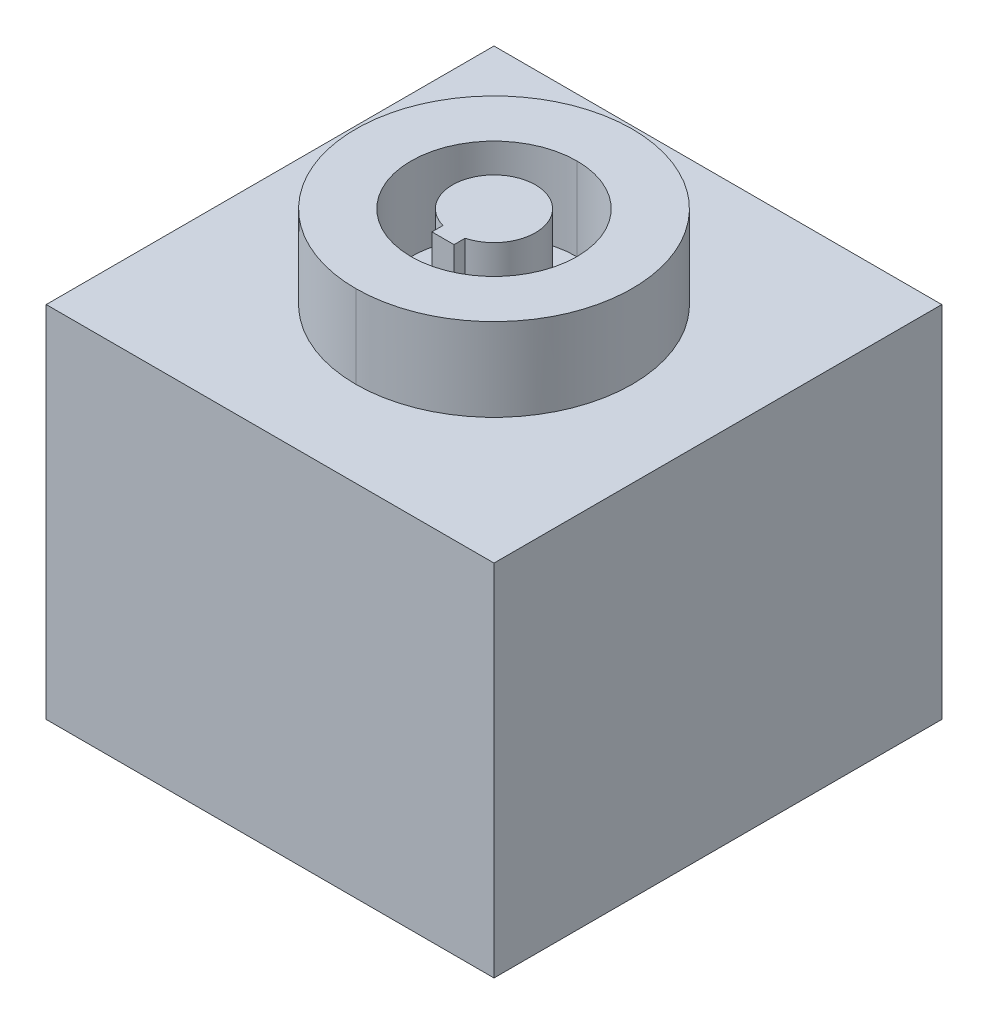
ISO-10303-21;
HEADER;
FILE_DESCRIPTION(('STEP AP214'),'2;1');
FILE_NAME('part.step','',(''),(''),'','','');
FILE_SCHEMA(('AUTOMOTIVE_DESIGN { 1 0 10303 214 1 1 1 1 }'));
ENDSEC;
DATA;
#1=APPLICATION_CONTEXT('core data for automotive mechanical design processes');
#2=APPLICATION_PROTOCOL_DEFINITION('international standard','automotive_design',2000,#1);
#3=PRODUCT_CONTEXT('',#1,'mechanical');
#4=PRODUCT('Part','Part','',(#3));
#5=PRODUCT_RELATED_PRODUCT_CATEGORY('part','',(#4));
#6=PRODUCT_DEFINITION_FORMATION('','',#4);
#7=PRODUCT_DEFINITION_CONTEXT('part definition',#1,'design');
#8=PRODUCT_DEFINITION('design','',#6,#7);
#9=PRODUCT_DEFINITION_SHAPE('','',#8);
#10=(LENGTH_UNIT() NAMED_UNIT(*) SI_UNIT(.MILLI.,.METRE.));
#11=(NAMED_UNIT(*) PLANE_ANGLE_UNIT() SI_UNIT($,.RADIAN.));
#12=(NAMED_UNIT(*) SI_UNIT($,.STERADIAN.) SOLID_ANGLE_UNIT());
#13=UNCERTAINTY_MEASURE_WITH_UNIT(LENGTH_MEASURE(1.E-05),#10,'distance_accuracy_value','');
#14=(GEOMETRIC_REPRESENTATION_CONTEXT(3) GLOBAL_UNCERTAINTY_ASSIGNED_CONTEXT((#13)) GLOBAL_UNIT_ASSIGNED_CONTEXT((#10,
#11,#12)) REPRESENTATION_CONTEXT('',''));
#15=CARTESIAN_POINT('',(0.,0.,0.));
#16=DIRECTION('',(0.,0.,1.));
#17=DIRECTION('',(1.,0.,0.));
#18=AXIS2_PLACEMENT_3D('',#15,#16,#17);
#19=CARTESIAN_POINT('',(-40.5,0.,-40.5));
#20=DIRECTION('',(0.,-1.,0.));
#21=DIRECTION('',(1.,0.,0.));
#22=AXIS2_PLACEMENT_3D('',#19,#20,#21);
#23=PLANE('',#22);
#24=CARTESIAN_POINT('',(-40.5,0.,40.5));
#25=DIRECTION('',(1.,0.,0.));
#26=VECTOR('',#25,1.);
#27=LINE('',#24,#26);
#28=CARTESIAN_POINT('',(-40.5,0.,40.5));
#29=VERTEX_POINT('',#28);
#30=CARTESIAN_POINT('',(40.5,0.,40.5));
#31=VERTEX_POINT('',#30);
#32=EDGE_CURVE('E11',#29,#31,#27,.T.);
#33=ORIENTED_EDGE('',*,*,#32,.F.);
#34=CARTESIAN_POINT('',(-40.5,0.,-40.5));
#35=DIRECTION('',(0.,0.,1.));
#36=VECTOR('',#35,1.);
#37=LINE('',#34,#36);
#38=CARTESIAN_POINT('',(-40.5,0.,-40.5));
#39=VERTEX_POINT('',#38);
#40=EDGE_CURVE('E25',#39,#29,#37,.T.);
#41=ORIENTED_EDGE('',*,*,#40,.F.);
#42=CARTESIAN_POINT('',(40.5,0.,-40.5));
#43=DIRECTION('',(-1.,0.,0.));
#44=VECTOR('',#43,1.);
#45=LINE('',#42,#44);
#46=CARTESIAN_POINT('',(40.5,0.,-40.5));
#47=VERTEX_POINT('',#46);
#48=EDGE_CURVE('E491',#47,#39,#45,.T.);
#49=ORIENTED_EDGE('',*,*,#48,.F.);
#50=CARTESIAN_POINT('',(40.5,0.,40.5));
#51=DIRECTION('',(0.,0.,-1.));
#52=VECTOR('',#51,1.);
#53=LINE('',#50,#52);
#54=EDGE_CURVE('E489',#31,#47,#53,.T.);
#55=ORIENTED_EDGE('',*,*,#54,.F.);
#56=EDGE_LOOP('',(#33,#41,#49,#55));
#57=FACE_BOUND('',#56,.T.);
#58=CARTESIAN_POINT('',(25.5,0.,25.5));
#59=DIRECTION('',(0.,0.,-1.));
#60=VECTOR('',#59,1.);
#61=LINE('',#58,#60);
#62=CARTESIAN_POINT('',(25.5,0.,25.5));
#63=VERTEX_POINT('',#62);
#64=CARTESIAN_POINT('',(25.5,0.,-25.5));
#65=VERTEX_POINT('',#64);
#66=EDGE_CURVE('E487',#63,#65,#61,.T.);
#67=ORIENTED_EDGE('',*,*,#66,.T.);
#68=CARTESIAN_POINT('',(25.5,0.,-25.5));
#69=DIRECTION('',(-1.,0.,0.));
#70=VECTOR('',#69,1.);
#71=LINE('',#68,#70);
#72=CARTESIAN_POINT('',(-25.5,0.,-25.5));
#73=VERTEX_POINT('',#72);
#74=EDGE_CURVE('E485',#65,#73,#71,.T.);
#75=ORIENTED_EDGE('',*,*,#74,.T.);
#76=CARTESIAN_POINT('',(-25.5,0.,-25.5));
#77=DIRECTION('',(0.,0.,1.));
#78=VECTOR('',#77,1.);
#79=LINE('',#76,#78);
#80=CARTESIAN_POINT('',(-25.5,0.,25.5));
#81=VERTEX_POINT('',#80);
#82=EDGE_CURVE('E482',#73,#81,#79,.T.);
#83=ORIENTED_EDGE('',*,*,#82,.T.);
#84=CARTESIAN_POINT('',(-25.5,0.,25.5));
#85=DIRECTION('',(1.,0.,0.));
#86=VECTOR('',#85,1.);
#87=LINE('',#84,#86);
#88=EDGE_CURVE('E480',#81,#63,#87,.T.);
#89=ORIENTED_EDGE('',*,*,#88,.T.);
#90=EDGE_LOOP('',(#67,#75,#83,#89));
#91=FACE_BOUND('',#90,.T.);
#92=ADVANCED_FACE('F16',(#57,#91),#23,.T.);
#93=CARTESIAN_POINT('',(25.5,0.,25.5));
#94=DIRECTION('',(0.,0.,-1.));
#95=DIRECTION('',(-1.,0.,0.));
#96=AXIS2_PLACEMENT_3D('',#93,#94,#95);
#97=PLANE('',#96);
#98=ORIENTED_EDGE('',*,*,#88,.F.);
#99=CARTESIAN_POINT('',(-25.5,50.,25.5));
#100=DIRECTION('',(0.,-1.,0.));
#101=VECTOR('',#100,1.);
#102=LINE('',#99,#101);
#103=CARTESIAN_POINT('',(-25.5,50.,25.5));
#104=VERTEX_POINT('',#103);
#105=EDGE_CURVE('E478',#104,#81,#102,.T.);
#106=ORIENTED_EDGE('',*,*,#105,.F.);
#107=CARTESIAN_POINT('',(-25.5,50.,25.5));
#108=DIRECTION('',(1.,0.,0.));
#109=VECTOR('',#108,1.);
#110=LINE('',#107,#109);
#111=CARTESIAN_POINT('',(25.5,50.,25.5));
#112=VERTEX_POINT('',#111);
#113=EDGE_CURVE('E474',#104,#112,#110,.T.);
#114=ORIENTED_EDGE('',*,*,#113,.T.);
#115=CARTESIAN_POINT('',(25.5,50.,25.5));
#116=DIRECTION('',(0.,-1.,0.));
#117=VECTOR('',#116,1.);
#118=LINE('',#115,#117);
#119=EDGE_CURVE('E469',#112,#63,#118,.T.);
#120=ORIENTED_EDGE('',*,*,#119,.T.);
#121=EDGE_LOOP('',(#98,#106,#114,#120));
#122=FACE_BOUND('',#121,.T.);
#123=ADVANCED_FACE('F730',(#122),#97,.T.);
#124=CARTESIAN_POINT('',(25.5,0.,-25.5));
#125=DIRECTION('',(-1.,0.,0.));
#126=DIRECTION('',(0.,0.,1.));
#127=AXIS2_PLACEMENT_3D('',#124,#125,#126);
#128=PLANE('',#127);
#129=ORIENTED_EDGE('',*,*,#66,.F.);
#130=ORIENTED_EDGE('',*,*,#119,.F.);
#131=CARTESIAN_POINT('',(25.5,50.,25.5));
#132=DIRECTION('',(0.,0.,-1.));
#133=VECTOR('',#132,1.);
#134=LINE('',#131,#133);
#135=CARTESIAN_POINT('',(25.5,50.,-25.5));
#136=VERTEX_POINT('',#135);
#137=EDGE_CURVE('E465',#112,#136,#134,.T.);
#138=ORIENTED_EDGE('',*,*,#137,.T.);
#139=CARTESIAN_POINT('',(25.5,50.,-25.5));
#140=DIRECTION('',(0.,-1.,0.));
#141=VECTOR('',#140,1.);
#142=LINE('',#139,#141);
#143=EDGE_CURVE('E460',#136,#65,#142,.T.);
#144=ORIENTED_EDGE('',*,*,#143,.T.);
#145=EDGE_LOOP('',(#129,#130,#138,#144));
#146=FACE_BOUND('',#145,.T.);
#147=ADVANCED_FACE('F667',(#146),#128,.T.);
#148=CARTESIAN_POINT('',(-25.5,0.,-25.5));
#149=DIRECTION('',(0.,0.,1.));
#150=DIRECTION('',(1.,0.,0.));
#151=AXIS2_PLACEMENT_3D('',#148,#149,#150);
#152=PLANE('',#151);
#153=ORIENTED_EDGE('',*,*,#74,.F.);
#154=ORIENTED_EDGE('',*,*,#143,.F.);
#155=CARTESIAN_POINT('',(25.5,50.,-25.5));
#156=DIRECTION('',(-1.,0.,0.));
#157=VECTOR('',#156,1.);
#158=LINE('',#155,#157);
#159=CARTESIAN_POINT('',(-25.5,50.,-25.5));
#160=VERTEX_POINT('',#159);
#161=EDGE_CURVE('E455',#136,#160,#158,.T.);
#162=ORIENTED_EDGE('',*,*,#161,.T.);
#163=CARTESIAN_POINT('',(-25.5,50.,-25.5));
#164=DIRECTION('',(0.,-1.,0.));
#165=VECTOR('',#164,1.);
#166=LINE('',#163,#165);
#167=EDGE_CURVE('E447',#160,#73,#166,.T.);
#168=ORIENTED_EDGE('',*,*,#167,.T.);
#169=EDGE_LOOP('',(#153,#154,#162,#168));
#170=FACE_BOUND('',#169,.T.);
#171=ADVANCED_FACE('F658',(#170),#152,.T.);
#172=CARTESIAN_POINT('',(-25.5,0.,25.5));
#173=DIRECTION('',(1.,0.,0.));
#174=DIRECTION('',(0.,0.,-1.));
#175=AXIS2_PLACEMENT_3D('',#172,#173,#174);
#176=PLANE('',#175);
#177=ORIENTED_EDGE('',*,*,#82,.F.);
#178=ORIENTED_EDGE('',*,*,#167,.F.);
#179=CARTESIAN_POINT('',(-25.5,50.,-25.5));
#180=DIRECTION('',(0.,0.,1.));
#181=VECTOR('',#180,1.);
#182=LINE('',#179,#181);
#183=EDGE_CURVE('E443',#160,#104,#182,.T.);
#184=ORIENTED_EDGE('',*,*,#183,.T.);
#185=ORIENTED_EDGE('',*,*,#105,.T.);
#186=EDGE_LOOP('',(#177,#178,#184,#185));
#187=FACE_BOUND('',#186,.T.);
#188=ADVANCED_FACE('F592',(#187),#176,.T.);
#189=CARTESIAN_POINT('',(-25.5,50.,25.5));
#190=DIRECTION('',(0.,-1.,0.));
#191=DIRECTION('',(0.,0.,-1.));
#192=AXIS2_PLACEMENT_3D('',#189,#190,#191);
#193=PLANE('',#192);
#194=ORIENTED_EDGE('',*,*,#161,.F.);
#195=ORIENTED_EDGE('',*,*,#137,.F.);
#196=ORIENTED_EDGE('',*,*,#113,.F.);
#197=ORIENTED_EDGE('',*,*,#183,.F.);
#198=EDGE_LOOP('',(#194,#195,#196,#197));
#199=FACE_BOUND('',#198,.T.);
#200=ADVANCED_FACE('F583',(#199),#193,.T.);
#201=CARTESIAN_POINT('',(40.5,0.,-40.5));
#202=DIRECTION('',(1.,0.,0.));
#203=DIRECTION('',(0.,1.,0.));
#204=AXIS2_PLACEMENT_3D('',#201,#202,#203);
#205=PLANE('',#204);
#206=ORIENTED_EDGE('',*,*,#54,.T.);
#207=CARTESIAN_POINT('',(40.5,65.,-40.5));
#208=DIRECTION('',(0.,-1.,0.));
#209=VECTOR('',#208,1.);
#210=LINE('',#207,#209);
#211=CARTESIAN_POINT('',(40.5,65.,-40.5));
#212=VERTEX_POINT('',#211);
#213=EDGE_CURVE('E440',#212,#47,#210,.T.);
#214=ORIENTED_EDGE('',*,*,#213,.F.);
#215=CARTESIAN_POINT('',(40.5,65.,40.5));
#216=DIRECTION('',(0.,0.,-1.));
#217=VECTOR('',#216,1.);
#218=LINE('',#215,#217);
#219=CARTESIAN_POINT('',(40.5,65.,40.5));
#220=VERTEX_POINT('',#219);
#221=EDGE_CURVE('E435',#220,#212,#218,.T.);
#222=ORIENTED_EDGE('',*,*,#221,.F.);
#223=CARTESIAN_POINT('',(40.5,65.,40.5));
#224=DIRECTION('',(0.,-1.,0.));
#225=VECTOR('',#224,1.);
#226=LINE('',#223,#225);
#227=EDGE_CURVE('E432',#220,#31,#226,.T.);
#228=ORIENTED_EDGE('',*,*,#227,.T.);
#229=EDGE_LOOP('',(#206,#214,#222,#228));
#230=FACE_BOUND('',#229,.T.);
#231=ADVANCED_FACE('F515',(#230),#205,.T.);
#232=CARTESIAN_POINT('',(40.5,0.,40.5));
#233=DIRECTION('',(0.,0.,1.));
#234=DIRECTION('',(0.,1.,0.));
#235=AXIS2_PLACEMENT_3D('',#232,#233,#234);
#236=PLANE('',#235);
#237=ORIENTED_EDGE('',*,*,#32,.T.);
#238=ORIENTED_EDGE('',*,*,#227,.F.);
#239=CARTESIAN_POINT('',(-40.5,65.,40.5));
#240=DIRECTION('',(1.,0.,0.));
#241=VECTOR('',#240,1.);
#242=LINE('',#239,#241);
#243=CARTESIAN_POINT('',(-40.5,65.,40.5));
#244=VERTEX_POINT('',#243);
#245=EDGE_CURVE('E428',#244,#220,#242,.T.);
#246=ORIENTED_EDGE('',*,*,#245,.F.);
#247=CARTESIAN_POINT('',(-40.5,65.,40.5));
#248=DIRECTION('',(0.,-1.,0.));
#249=VECTOR('',#248,1.);
#250=LINE('',#247,#249);
#251=EDGE_CURVE('E425',#244,#29,#250,.T.);
#252=ORIENTED_EDGE('',*,*,#251,.T.);
#253=EDGE_LOOP('',(#237,#238,#246,#252));
#254=FACE_BOUND('',#253,.T.);
#255=ADVANCED_FACE('F506',(#254),#236,.T.);
#256=CARTESIAN_POINT('',(-40.5,0.,40.5));
#257=DIRECTION('',(-1.,0.,0.));
#258=DIRECTION('',(0.,1.,0.));
#259=AXIS2_PLACEMENT_3D('',#256,#257,#258);
#260=PLANE('',#259);
#261=ORIENTED_EDGE('',*,*,#40,.T.);
#262=ORIENTED_EDGE('',*,*,#251,.F.);
#263=CARTESIAN_POINT('',(-40.5,65.,-40.5));
#264=DIRECTION('',(0.,0.,1.));
#265=VECTOR('',#264,1.);
#266=LINE('',#263,#265);
#267=CARTESIAN_POINT('',(-40.5,65.,-40.5));
#268=VERTEX_POINT('',#267);
#269=EDGE_CURVE('E420',#268,#244,#266,.T.);
#270=ORIENTED_EDGE('',*,*,#269,.F.);
#271=CARTESIAN_POINT('',(-40.5,65.,-40.5));
#272=DIRECTION('',(0.,-1.,0.));
#273=VECTOR('',#272,1.);
#274=LINE('',#271,#273);
#275=EDGE_CURVE('E414',#268,#39,#274,.T.);
#276=ORIENTED_EDGE('',*,*,#275,.T.);
#277=EDGE_LOOP('',(#261,#262,#270,#276));
#278=FACE_BOUND('',#277,.T.);
#279=ADVANCED_FACE('F495',(#278),#260,.T.);
#280=CARTESIAN_POINT('',(-40.5,0.,-40.5));
#281=DIRECTION('',(0.,0.,-1.));
#282=DIRECTION('',(0.,1.,0.));
#283=AXIS2_PLACEMENT_3D('',#280,#281,#282);
#284=PLANE('',#283);
#285=ORIENTED_EDGE('',*,*,#48,.T.);
#286=ORIENTED_EDGE('',*,*,#275,.F.);
#287=CARTESIAN_POINT('',(40.5,65.,-40.5));
#288=DIRECTION('',(-1.,0.,0.));
#289=VECTOR('',#288,1.);
#290=LINE('',#287,#289);
#291=EDGE_CURVE('E411',#212,#268,#290,.T.);
#292=ORIENTED_EDGE('',*,*,#291,.F.);
#293=ORIENTED_EDGE('',*,*,#213,.T.);
#294=EDGE_LOOP('',(#285,#286,#292,#293));
#295=FACE_BOUND('',#294,.T.);
#296=ADVANCED_FACE('F869',(#295),#284,.T.);
#297=CARTESIAN_POINT('',(-40.5,65.,40.5));
#298=DIRECTION('',(0.,1.,0.));
#299=DIRECTION('',(1.,0.,0.));
#300=AXIS2_PLACEMENT_3D('',#297,#298,#299);
#301=PLANE('',#300);
#302=ORIENTED_EDGE('',*,*,#221,.T.);
#303=ORIENTED_EDGE('',*,*,#291,.T.);
#304=ORIENTED_EDGE('',*,*,#269,.T.);
#305=ORIENTED_EDGE('',*,*,#245,.T.);
#306=EDGE_LOOP('',(#302,#303,#304,#305));
#307=FACE_BOUND('',#306,.T.);
#308=CARTESIAN_POINT('',(0.,65.,0.));
#309=DIRECTION('',(0.,1.,0.));
#310=DIRECTION('',(0.,0.,-1.));
#311=AXIS2_PLACEMENT_3D('',#308,#309,#310);
#312=CIRCLE('',#311,25.);
#313=CARTESIAN_POINT('',(0.,65.,-25.));
#314=VERTEX_POINT('',#313);
#315=CARTESIAN_POINT('',(-9.12550270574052E-11,65.,25.0000241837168));
#316=VERTEX_POINT('',#315);
#317=EDGE_CURVE('E408',#314,#316,#312,.T.);
#318=ORIENTED_EDGE('',*,*,#317,.F.);
#319=CARTESIAN_POINT('',(0.,65.,0.));
#320=DIRECTION('',(0.,1.,0.));
#321=DIRECTION('',(-3.6556199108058E-12,0.,1.));
#322=AXIS2_PLACEMENT_3D('',#319,#320,#321);
#323=CIRCLE('',#322,25.);
#324=EDGE_CURVE('E405',#316,#314,#323,.T.);
#325=ORIENTED_EDGE('',*,*,#324,.F.);
#326=EDGE_LOOP('',(#318,#325));
#327=FACE_BOUND('',#326,.T.);
#328=ADVANCED_FACE('F875',(#307,#327),#301,.T.);
#329=CARTESIAN_POINT('',(0.,80.,0.));
#330=DIRECTION('',(0.,-1.,0.));
#331=DIRECTION('',(-1.,0.,-1.82526788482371E-12));
#332=AXIS2_PLACEMENT_3D('',#329,#330,#331);
#333=CYLINDRICAL_SURFACE('',#332,25.);
#334=ORIENTED_EDGE('',*,*,#324,.T.);
#335=CARTESIAN_POINT('',(0.,80.,-25.));
#336=DIRECTION('',(0.,-1.,0.));
#337=VECTOR('',#336,1.);
#338=LINE('',#335,#337);
#339=CARTESIAN_POINT('',(0.,80.,-25.));
#340=VERTEX_POINT('',#339);
#341=EDGE_CURVE('E402',#340,#314,#338,.T.);
#342=ORIENTED_EDGE('',*,*,#341,.F.);
#343=CARTESIAN_POINT('',(0.,80.,25.));
#344=CARTESIAN_POINT('',(6.6304899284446,80.,24.9999026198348));
#345=CARTESIAN_POINT('',(12.9891747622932,80.,22.3661522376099));
#346=CARTESIAN_POINT('',(20.795524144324,80.,14.559822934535));
#347=CARTESIAN_POINT('',(23.0332057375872,80.,10.6729440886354));
#348=CARTESIAN_POINT('',(25.8643739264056,80.,0.0023601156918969));
#349=CARTESIAN_POINT('',(24.9491235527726,80.,-6.8191926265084));
#350=CARTESIAN_POINT('',(19.0705976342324,80.,-16.9437262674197));
#351=CARTESIAN_POINT('',(15.2448310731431,80.,-20.4541113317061));
#352=CARTESIAN_POINT('',(7.3198449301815,80.,-24.1864229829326));
#353=CARTESIAN_POINT('',(3.6829281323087,80.,-24.9999459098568));
#354=CARTESIAN_POINT('',(0.,80.,-25.));
#355=B_SPLINE_CURVE_WITH_KNOTS('',3,(#343,#344,#345,#346,#347,#348,#349,#350,#351,#352,#353,
#354),.UNSPECIFIED.,.F.,.F.,(4,2,2,2,2,4),(0.,0.250867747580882,0.417695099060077,
0.668562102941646,0.860652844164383,1.),.UNSPECIFIED.);
#356=CARTESIAN_POINT('',(0.,80.,25.));
#357=VERTEX_POINT('',#356);
#358=EDGE_CURVE('E397',#357,#340,#355,.T.);
#359=ORIENTED_EDGE('',*,*,#358,.F.);
#360=CARTESIAN_POINT('',(-9.13238843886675E-11,65.,25.));
#361=CARTESIAN_POINT('',(-8.75171969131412E-11,65.625,25.));
#362=CARTESIAN_POINT('',(-8.37163072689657E-11,66.25,25.));
#363=CARTESIAN_POINT('',(-7.61163783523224E-11,67.5,25.));
#364=CARTESIAN_POINT('',(-7.23173390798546E-11,68.125,25.));
#365=CARTESIAN_POINT('',(-6.47113656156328E-11,69.375,25.));
#366=CARTESIAN_POINT('',(-6.09044314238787E-11,70.,25.));
#367=CARTESIAN_POINT('',(-5.32980878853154E-11,71.25,25.));
#368=CARTESIAN_POINT('',(-4.9498678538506E-11,71.875,25.));
#369=CARTESIAN_POINT('',(-4.18998598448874E-11,73.125,25.));
#370=CARTESIAN_POINT('',(-3.8100450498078E-11,73.75,25.));
#371=CARTESIAN_POINT('',(-3.04941069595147E-11,75.,25.));
#372=CARTESIAN_POINT('',(-2.66871727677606E-11,75.625,25.));
#373=CARTESIAN_POINT('',(-1.90811993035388E-11,76.875,25.));
#374=CARTESIAN_POINT('',(-1.5282160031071E-11,77.5,25.));
#375=CARTESIAN_POINT('',(-7.68223111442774E-12,78.75,25.));
#376=CARTESIAN_POINT('',(-3.88134147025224E-12,79.375,25.));
#377=CARTESIAN_POINT('',(0.,80.,25.));
#378=B_SPLINE_CURVE_WITH_KNOTS('',3,(#360,#361,#362,#363,#364,#365,#366,#367,#368,#369,#370,
#371,#372,#373,#374,#375,#376,#377),.UNSPECIFIED.,.F.,.F.,(4,2,2,2,2,2,2,2,4),(0.,1.875,3.75,
5.62499999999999,7.49999999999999,9.37499999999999,11.25,13.125,15.),.UNSPECIFIED.);
#379=EDGE_CURVE('E391',#316,#357,#378,.T.);
#380=ORIENTED_EDGE('',*,*,#379,.F.);
#381=EDGE_LOOP('',(#334,#342,#359,#380));
#382=FACE_BOUND('',#381,.T.);
#383=ADVANCED_FACE('F881',(#382),#333,.T.);
#384=CARTESIAN_POINT('',(0.,80.,0.));
#385=DIRECTION('',(0.,-1.,0.));
#386=DIRECTION('',(1.,0.,0.));
#387=AXIS2_PLACEMENT_3D('',#384,#385,#386);
#388=CYLINDRICAL_SURFACE('',#387,25.);
#389=CARTESIAN_POINT('',(0.,80.,-25.));
#390=CARTESIAN_POINT('',(-6.6304899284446,80.,-24.9999026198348));
#391=CARTESIAN_POINT('',(-12.9891747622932,80.,-22.3661522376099));
#392=CARTESIAN_POINT('',(-20.7955241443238,80.,-14.559822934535));
#393=CARTESIAN_POINT('',(-23.0332057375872,80.,-10.6729440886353));
#394=CARTESIAN_POINT('',(-25.8643739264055,80.,-0.00236011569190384));
#395=CARTESIAN_POINT('',(-24.9491235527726,80.,6.8191926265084));
#396=CARTESIAN_POINT('',(-19.0705976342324,80.,16.9437262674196));
#397=CARTESIAN_POINT('',(-15.2448310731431,80.,20.4541113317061));
#398=CARTESIAN_POINT('',(-7.3198449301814,80.,24.1864229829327));
#399=CARTESIAN_POINT('',(-3.6829281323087,80.,24.9999459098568));
#400=CARTESIAN_POINT('',(0.,80.,25.));
#401=B_SPLINE_CURVE_WITH_KNOTS('',3,(#389,#390,#391,#392,#393,#394,#395,#396,#397,#398,#399,
#400),.UNSPECIFIED.,.F.,.F.,(4,2,2,2,2,4),(0.,0.250867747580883,0.417695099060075,
0.668562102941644,0.86065284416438,1.),.UNSPECIFIED.);
#402=EDGE_CURVE('E388',#340,#357,#401,.T.);
#403=ORIENTED_EDGE('',*,*,#402,.F.);
#404=ORIENTED_EDGE('',*,*,#341,.T.);
#405=ORIENTED_EDGE('',*,*,#317,.T.);
#406=ORIENTED_EDGE('',*,*,#379,.T.);
#407=EDGE_LOOP('',(#403,#404,#405,#406));
#408=FACE_BOUND('',#407,.T.);
#409=ADVANCED_FACE('F888',(#408),#388,.T.);
#410=CARTESIAN_POINT('',(-25.8643739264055,80.,-25.));
#411=DIRECTION('',(0.,1.,0.));
#412=DIRECTION('',(0.,0.,1.));
#413=AXIS2_PLACEMENT_3D('',#410,#411,#412);
#414=PLANE('',#413);
#415=ORIENTED_EDGE('',*,*,#358,.T.);
#416=ORIENTED_EDGE('',*,*,#402,.T.);
#417=EDGE_LOOP('',(#415,#416));
#418=FACE_BOUND('',#417,.T.);
#419=CARTESIAN_POINT('',(0.,80.,0.));
#420=DIRECTION('',(0.,1.,0.));
#421=DIRECTION('',(0.,0.,-1.));
#422=AXIS2_PLACEMENT_3D('',#419,#420,#421);
#423=CIRCLE('',#422,15.);
#424=CARTESIAN_POINT('',(0.,80.,-15.));
#425=VERTEX_POINT('',#424);
#426=CARTESIAN_POINT('',(0.,80.,15.));
#427=VERTEX_POINT('',#426);
#428=EDGE_CURVE('E386',#425,#427,#423,.T.);
#429=ORIENTED_EDGE('',*,*,#428,.F.);
#430=CARTESIAN_POINT('',(0.,80.,0.));
#431=DIRECTION('',(0.,1.,0.));
#432=DIRECTION('',(0.,0.,1.));
#433=AXIS2_PLACEMENT_3D('',#430,#431,#432);
#434=CIRCLE('',#433,15.);
#435=EDGE_CURVE('E384',#427,#425,#434,.T.);
#436=ORIENTED_EDGE('',*,*,#435,.F.);
#437=EDGE_LOOP('',(#429,#436));
#438=FACE_BOUND('',#437,.T.);
#439=ADVANCED_FACE('F895',(#418,#438),#414,.T.);
#440=CARTESIAN_POINT('',(0.,80.,0.));
#441=DIRECTION('',(0.,-1.,0.));
#442=DIRECTION('',(-1.,0.,0.));
#443=AXIS2_PLACEMENT_3D('',#440,#441,#442);
#444=CYLINDRICAL_SURFACE('',#443,15.);
#445=ORIENTED_EDGE('',*,*,#435,.T.);
#446=CARTESIAN_POINT('',(0.,80.,-15.));
#447=DIRECTION('',(0.,-1.,0.));
#448=VECTOR('',#447,1.);
#449=LINE('',#446,#448);
#450=CARTESIAN_POINT('',(0.,65.,-15.));
#451=VERTEX_POINT('',#450);
#452=EDGE_CURVE('E383',#425,#451,#449,.T.);
#453=ORIENTED_EDGE('',*,*,#452,.T.);
#454=CARTESIAN_POINT('',(0.,65.,15.));
#455=CARTESIAN_POINT('',(3.9782939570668,65.,14.9999415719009));
#456=CARTESIAN_POINT('',(7.793504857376,65.,13.4196913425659));
#457=CARTESIAN_POINT('',(12.4773144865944,65.,8.73589376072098));
#458=CARTESIAN_POINT('',(13.8199234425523,65.,6.40376645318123));
#459=CARTESIAN_POINT('',(15.5186243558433,65.,0.00141606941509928));
#460=CARTESIAN_POINT('',(14.9694741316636,65.,-4.091515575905));
#461=CARTESIAN_POINT('',(11.4423585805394,65.,-10.1662357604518));
#462=CARTESIAN_POINT('',(9.1468986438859,65.,-12.2724667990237));
#463=CARTESIAN_POINT('',(4.3919069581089,65.,-14.5118537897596));
#464=CARTESIAN_POINT('',(2.2097568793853,65.,-14.9999675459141));
#465=CARTESIAN_POINT('',(0.,65.,-15.));
#466=B_SPLINE_CURVE_WITH_KNOTS('',3,(#454,#455,#456,#457,#458,#459,#460,#461,#462,#463,#464,
#465),.UNSPECIFIED.,.F.,.F.,(4,2,2,2,2,4),(0.,0.250867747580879,0.417695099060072,
0.668562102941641,0.860652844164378,1.),.UNSPECIFIED.);
#467=CARTESIAN_POINT('',(0.,65.,15.));
#468=VERTEX_POINT('',#467);
#469=EDGE_CURVE('E372',#468,#451,#466,.T.);
#470=ORIENTED_EDGE('',*,*,#469,.F.);
#471=CARTESIAN_POINT('',(0.,65.,15.));
#472=DIRECTION('',(0.,1.,0.));
#473=VECTOR('',#472,1.);
#474=LINE('',#471,#473);
#475=EDGE_CURVE('E377',#468,#427,#474,.T.);
#476=ORIENTED_EDGE('',*,*,#475,.T.);
#477=EDGE_LOOP('',(#445,#453,#470,#476));
#478=FACE_BOUND('',#477,.T.);
#479=ADVANCED_FACE('F902',(#478),#444,.F.);
#480=CARTESIAN_POINT('',(0.,80.,0.));
#481=DIRECTION('',(0.,-1.,0.));
#482=DIRECTION('',(1.,0.,0.));
#483=AXIS2_PLACEMENT_3D('',#480,#481,#482);
#484=CYLINDRICAL_SURFACE('',#483,15.);
#485=CARTESIAN_POINT('',(0.,65.,-15.));
#486=CARTESIAN_POINT('',(-3.9782939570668,65.,-14.9999415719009));
#487=CARTESIAN_POINT('',(-7.79350485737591,65.,-13.4196913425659));
#488=CARTESIAN_POINT('',(-12.4773144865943,65.,-8.735893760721));
#489=CARTESIAN_POINT('',(-13.8199234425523,65.,-6.4037664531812));
#490=CARTESIAN_POINT('',(-15.5186243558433,65.,-0.00141606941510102));
#491=CARTESIAN_POINT('',(-14.9694741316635,65.,4.091515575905));
#492=CARTESIAN_POINT('',(-11.4423585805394,65.,10.1662357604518));
#493=CARTESIAN_POINT('',(-9.14689864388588,65.,12.2724667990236));
#494=CARTESIAN_POINT('',(-4.3919069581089,65.,14.5118537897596));
#495=CARTESIAN_POINT('',(-2.2097568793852,65.,14.9999675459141));
#496=CARTESIAN_POINT('',(0.,65.,15.));
#497=B_SPLINE_CURVE_WITH_KNOTS('',3,(#485,#486,#487,#488,#489,#490,#491,#492,#493,#494,#495,
#496),.UNSPECIFIED.,.F.,.F.,(4,2,2,2,2,4),(0.,0.250867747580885,0.417695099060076,
0.668562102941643,0.860652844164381,1.),.UNSPECIFIED.);
#498=EDGE_CURVE('E371',#451,#468,#497,.T.);
#499=ORIENTED_EDGE('',*,*,#498,.F.);
#500=ORIENTED_EDGE('',*,*,#452,.F.);
#501=ORIENTED_EDGE('',*,*,#428,.T.);
#502=ORIENTED_EDGE('',*,*,#475,.F.);
#503=EDGE_LOOP('',(#499,#500,#501,#502));
#504=FACE_BOUND('',#503,.T.);
#505=ADVANCED_FACE('F326',(#504),#484,.F.);
#506=CARTESIAN_POINT('',(-15.5186243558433,65.,15.));
#507=DIRECTION('',(0.,1.,0.));
#508=DIRECTION('',(1.,0.,0.));
#509=AXIS2_PLACEMENT_3D('',#506,#507,#508);
#510=PLANE('',#509);
#511=ORIENTED_EDGE('',*,*,#469,.T.);
#512=ORIENTED_EDGE('',*,*,#498,.T.);
#513=EDGE_LOOP('',(#511,#512));
#514=FACE_BOUND('',#513,.T.);
#515=CARTESIAN_POINT('',(-2.,65.,7.22841614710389));
#516=DIRECTION('',(0.,0.,1.));
#517=VECTOR('',#516,1.);
#518=LINE('',#515,#517);
#519=CARTESIAN_POINT('',(-2.00000000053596,65.,7.22841614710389));
#520=VERTEX_POINT('',#519);
#521=CARTESIAN_POINT('',(-2.,65.,9.22841614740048));
#522=VERTEX_POINT('',#521);
#523=EDGE_CURVE('E223',#520,#522,#518,.T.);
#524=ORIENTED_EDGE('',*,*,#523,.F.);
#525=CARTESIAN_POINT('',(0.,65.,0.));
#526=DIRECTION('',(0.,1.,0.));
#527=DIRECTION('',(1.3886222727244E-10,0.,-1.));
#528=AXIS2_PLACEMENT_3D('',#525,#526,#527);
#529=CIRCLE('',#528,7.5);
#530=CARTESIAN_POINT('',(1.04145739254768E-09,65.,-7.50001984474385));
#531=VERTEX_POINT('',#530);
#532=EDGE_CURVE('E229',#531,#520,#529,.T.);
#533=ORIENTED_EDGE('',*,*,#532,.F.);
#534=CARTESIAN_POINT('',(0.,65.,0.));
#535=DIRECTION('',(0.,1.,0.));
#536=DIRECTION('',(0.26666666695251,0.,0.963788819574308));
#537=AXIS2_PLACEMENT_3D('',#534,#535,#536);
#538=CIRCLE('',#537,7.5);
#539=CARTESIAN_POINT('',(2.00000000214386,65.,7.22841614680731));
#540=VERTEX_POINT('',#539);
#541=EDGE_CURVE('E235',#540,#531,#538,.T.);
#542=ORIENTED_EDGE('',*,*,#541,.F.);
#543=CARTESIAN_POINT('',(2.,65.,9.22841614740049));
#544=DIRECTION('',(0.,0.,-1.));
#545=VECTOR('',#544,1.);
#546=LINE('',#543,#545);
#547=CARTESIAN_POINT('',(2.,65.,9.22841614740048));
#548=VERTEX_POINT('',#547);
#549=EDGE_CURVE('E158',#548,#540,#546,.T.);
#550=ORIENTED_EDGE('',*,*,#549,.F.);
#551=CARTESIAN_POINT('',(-2.,65.,9.22841614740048));
#552=DIRECTION('',(1.,0.,0.));
#553=VECTOR('',#552,1.);
#554=LINE('',#551,#553);
#555=EDGE_CURVE('E280',#522,#548,#554,.T.);
#556=ORIENTED_EDGE('',*,*,#555,.F.);
#557=EDGE_LOOP('',(#524,#533,#542,#550,#556));
#558=FACE_BOUND('',#557,.T.);
#559=ADVANCED_FACE('F317',(#514,#558),#510,.T.);
#560=CARTESIAN_POINT('',(2.,65.,9.22841614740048));
#561=DIRECTION('',(0.,0.,1.));
#562=DIRECTION('',(0.,1.,0.));
#563=AXIS2_PLACEMENT_3D('',#560,#561,#562);
#564=PLANE('',#563);
#565=ORIENTED_EDGE('',*,*,#555,.T.);
#566=CARTESIAN_POINT('',(2.,80.,9.22841614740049));
#567=DIRECTION('',(0.,-1.,0.));
#568=VECTOR('',#567,1.);
#569=LINE('',#566,#568);
#570=CARTESIAN_POINT('',(2.,80.,9.22841614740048));
#571=VERTEX_POINT('',#570);
#572=EDGE_CURVE('E304',#571,#548,#569,.T.);
#573=ORIENTED_EDGE('',*,*,#572,.F.);
#574=CARTESIAN_POINT('',(-2.,80.,9.22841614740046));
#575=DIRECTION('',(1.,0.,0.));
#576=VECTOR('',#575,1.);
#577=LINE('',#574,#576);
#578=CARTESIAN_POINT('',(-2.,80.,9.22841614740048));
#579=VERTEX_POINT('',#578);
#580=EDGE_CURVE('E165',#579,#571,#577,.T.);
#581=ORIENTED_EDGE('',*,*,#580,.F.);
#582=CARTESIAN_POINT('',(-2.,80.,9.22841614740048));
#583=DIRECTION('',(0.,-1.,0.));
#584=VECTOR('',#583,1.);
#585=LINE('',#582,#584);
#586=EDGE_CURVE('E216',#579,#522,#585,.T.);
#587=ORIENTED_EDGE('',*,*,#586,.T.);
#588=EDGE_LOOP('',(#565,#573,#581,#587));
#589=FACE_BOUND('',#588,.T.);
#590=ADVANCED_FACE('F251',(#589),#564,.T.);
#591=CARTESIAN_POINT('',(-2.,65.,9.22841614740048));
#592=DIRECTION('',(-1.,0.,0.));
#593=DIRECTION('',(0.,1.,0.));
#594=AXIS2_PLACEMENT_3D('',#591,#592,#593);
#595=PLANE('',#594);
#596=ORIENTED_EDGE('',*,*,#523,.T.);
#597=ORIENTED_EDGE('',*,*,#586,.F.);
#598=CARTESIAN_POINT('',(-2.00000000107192,80.,7.22841614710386));
#599=DIRECTION('',(5.35959731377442E-10,0.,1.));
#600=VECTOR('',#599,1.);
#601=LINE('',#598,#600);
#602=CARTESIAN_POINT('',(-2.00000000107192,80.,7.22841614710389));
#603=VERTEX_POINT('',#602);
#604=EDGE_CURVE('E209',#603,#579,#601,.T.);
#605=ORIENTED_EDGE('',*,*,#604,.F.);
#606=CARTESIAN_POINT('',(-2.,80.,7.22841614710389));
#607=DIRECTION('',(0.,-1.,0.));
#608=VECTOR('',#607,1.);
#609=LINE('',#606,#608);
#610=EDGE_CURVE('E217',#603,#520,#609,.T.);
#611=ORIENTED_EDGE('',*,*,#610,.T.);
#612=EDGE_LOOP('',(#596,#597,#605,#611));
#613=FACE_BOUND('',#612,.T.);
#614=ADVANCED_FACE('F222',(#613),#595,.T.);
#615=CARTESIAN_POINT('',(0.,80.,0.));
#616=DIRECTION('',(0.,-1.,0.));
#617=DIRECTION('',(0.99090585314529,0.,0.134557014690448));
#618=AXIS2_PLACEMENT_3D('',#615,#616,#617);
#619=CYLINDRICAL_SURFACE('',#618,7.5);
#620=ORIENTED_EDGE('',*,*,#532,.T.);
#621=ORIENTED_EDGE('',*,*,#610,.F.);
#622=CARTESIAN_POINT('',(-1.43554092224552E-09,80.,-7.50001229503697));
#623=CARTESIAN_POINT('',(-0.23693377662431,80.,-7.49999858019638));
#624=CARTESIAN_POINT('',(-0.47462628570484,80.,-7.48876688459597));
#625=CARTESIAN_POINT('',(-2.4345356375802,80.,-7.30203280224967));
#626=CARTESIAN_POINT('',(-4.04596780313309,80.,-6.54735402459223));
#627=CARTESIAN_POINT('',(-6.45163684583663,80.,-4.16684373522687));
#628=CARTESIAN_POINT('',(-7.20917770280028,80.,-2.64890297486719));
#629=CARTESIAN_POINT('',(-7.59437370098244,80.,0.188368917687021));
#630=CARTESIAN_POINT('',(-7.46556972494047,80.,1.40611408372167));
#631=CARTESIAN_POINT('',(-6.58433375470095,80.,3.85058300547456));
#632=CARTESIAN_POINT('',(-5.75842374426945,80.,5.00232231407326));
#633=CARTESIAN_POINT('',(-3.88078509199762,80.,6.49690984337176));
#634=CARTESIAN_POINT('',(-2.97286391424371,80.,6.95895504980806));
#635=CARTESIAN_POINT('',(-2.00000000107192,80.,7.22841614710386));
#636=B_SPLINE_CURVE_WITH_KNOTS('',3,(#622,#623,#624,#625,#626,#627,#628,#629,#630,#631,#632,
#633,#634,#635),.UNSPECIFIED.,.F.,.F.,(4,2,2,2,2,2,4),(0.,0.033016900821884,0.272236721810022,
0.501034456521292,0.668128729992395,0.860384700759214,1.),.UNSPECIFIED.);
#637=CARTESIAN_POINT('',(-1.43554546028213E-09,80.,-7.50001229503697));
#638=VERTEX_POINT('',#637);
#639=EDGE_CURVE('E210',#638,#603,#636,.T.);
#640=ORIENTED_EDGE('',*,*,#639,.F.);
#641=CARTESIAN_POINT('',(1.04149376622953E-09,65.,-7.5));
#642=CARTESIAN_POINT('',(9.38285138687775E-10,65.625,-7.5));
#643=CARTESIAN_POINT('',(8.35076050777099E-10,66.25,-7.5));
#644=CARTESIAN_POINT('',(6.28657250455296E-10,67.5,-7.5));
#645=CARTESIAN_POINT('',(5.25447538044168E-10,68.125,-7.5));
#646=CARTESIAN_POINT('',(3.19027784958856E-10,69.375,-7.5));
#647=CARTESIAN_POINT('',(2.15817744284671E-10,70.,-7.5));
#648=CARTESIAN_POINT('',(9.39918415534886E-12,71.25,-7.5));
#649=CARTESIAN_POINT('',(-9.38093352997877E-11,71.875,-7.5));
#650=CARTESIAN_POINT('',(-3.00227967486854E-10,73.125,-7.5));
#651=CARTESIAN_POINT('',(-4.03438080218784E-10,73.75,-7.5));
#652=CARTESIAN_POINT('',(-6.0985720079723E-10,75.,-7.5));
#653=CARTESIAN_POINT('',(-7.13066208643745E-10,75.625,-7.5));
#654=CARTESIAN_POINT('',(-9.19484136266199E-10,76.875,-7.5));
#655=CARTESIAN_POINT('',(-1.02269305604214E-09,77.5,-7.5));
#656=CARTESIAN_POINT('',(-1.22911152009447E-09,78.75,-7.5));
#657=CARTESIAN_POINT('',(-1.33232106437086E-09,79.375,-7.5));
#658=CARTESIAN_POINT('',(-1.43553127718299E-09,80.,-7.5));
#659=B_SPLINE_CURVE_WITH_KNOTS('',3,(#641,#642,#643,#644,#645,#646,#647,#648,#649,#650,#651,
#652,#653,#654,#655,#656,#657,#658),.UNSPECIFIED.,.F.,.F.,(4,2,2,2,2,2,2,2,4),(0.,1.875,3.75,
5.62500000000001,7.50000000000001,9.37499999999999,11.25,13.125,15.),.UNSPECIFIED.);
#660=EDGE_CURVE('E142',#531,#638,#659,.T.);
#661=ORIENTED_EDGE('',*,*,#660,.F.);
#662=EDGE_LOOP('',(#620,#621,#640,#661));
#663=FACE_BOUND('',#662,.T.);
#664=ADVANCED_FACE('F231',(#663),#619,.T.);
#665=CARTESIAN_POINT('',(0.,80.,0.));
#666=DIRECTION('',(0.,-1.,0.));
#667=DIRECTION('',(-0.990905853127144,0.,0.134557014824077));
#668=AXIS2_PLACEMENT_3D('',#665,#666,#667);
#669=CYLINDRICAL_SURFACE('',#668,7.5);
#670=CARTESIAN_POINT('',(2.00000000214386,80.,7.22841614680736));
#671=CARTESIAN_POINT('',(3.39395944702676,80.,6.84232119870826));
#672=CARTESIAN_POINT('',(4.64525084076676,80.,6.06342069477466));
#673=CARTESIAN_POINT('',(6.40833148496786,80.,4.07919715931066));
#674=CARTESIAN_POINT('',(6.98102287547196,80.,2.99559646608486));
#675=CARTESIAN_POINT('',(7.64134755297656,80.,0.36310024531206));
#676=CARTESIAN_POINT('',(7.55895970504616,80.,-1.17615428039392));
#677=CARTESIAN_POINT('',(6.50957963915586,80.,-4.02832389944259));
#678=CARTESIAN_POINT('',(5.55176533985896,80.,-5.2698616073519));
#679=CARTESIAN_POINT('',(3.03103249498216,80.,-7.0315840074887));
#680=CARTESIAN_POINT('',(1.53136380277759,80.,-7.50010637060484));
#681=CARTESIAN_POINT('',(-1.43554092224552E-09,80.,-7.50001229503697));
#682=B_SPLINE_CURVE_WITH_KNOTS('',3,(#670,#671,#672,#673,#674,#675,#676,#677,#678,#679,#680,
#681),.UNSPECIFIED.,.F.,.F.,(4,2,2,2,2,4),(0.,0.199917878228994,0.366841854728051,
0.575034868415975,0.786801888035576,1.),.UNSPECIFIED.);
#683=CARTESIAN_POINT('',(2.00000000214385,80.,7.22841614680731));
#684=VERTEX_POINT('',#683);
#685=EDGE_CURVE('E133',#684,#638,#682,.T.);
#686=ORIENTED_EDGE('',*,*,#685,.F.);
#687=CARTESIAN_POINT('',(2.00000000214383,80.,7.22841614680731));
#688=DIRECTION('',(0.,-1.,0.));
#689=VECTOR('',#688,1.);
#690=LINE('',#687,#689);
#691=EDGE_CURVE('E138',#684,#540,#690,.T.);
#692=ORIENTED_EDGE('',*,*,#691,.T.);
#693=ORIENTED_EDGE('',*,*,#541,.T.);
#694=ORIENTED_EDGE('',*,*,#660,.T.);
#695=EDGE_LOOP('',(#686,#692,#693,#694));
#696=FACE_BOUND('',#695,.T.);
#697=ADVANCED_FACE('F136',(#696),#669,.T.);
#698=CARTESIAN_POINT('',(2.,65.,7.22841614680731));
#699=DIRECTION('',(1.,0.,0.));
#700=DIRECTION('',(0.,1.,0.));
#701=AXIS2_PLACEMENT_3D('',#698,#699,#700);
#702=PLANE('',#701);
#703=ORIENTED_EDGE('',*,*,#549,.T.);
#704=ORIENTED_EDGE('',*,*,#691,.F.);
#705=CARTESIAN_POINT('',(2.,80.,9.22841614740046));
#706=DIRECTION('',(1.07192987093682E-09,0.,-1.));
#707=VECTOR('',#706,1.);
#708=LINE('',#705,#707);
#709=EDGE_CURVE('E155',#571,#684,#708,.T.);
#710=ORIENTED_EDGE('',*,*,#709,.F.);
#711=ORIENTED_EDGE('',*,*,#572,.T.);
#712=EDGE_LOOP('',(#703,#704,#710,#711));
#713=FACE_BOUND('',#712,.T.);
#714=ADVANCED_FACE('F153',(#713),#702,.T.);
#715=CARTESIAN_POINT('',(-7.59437370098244,80.,-7.50010637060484));
#716=DIRECTION('',(0.,1.,0.));
#717=DIRECTION('',(0.,0.,1.));
#718=AXIS2_PLACEMENT_3D('',#715,#716,#717);
#719=PLANE('',#718);
#720=ORIENTED_EDGE('',*,*,#639,.T.);
#721=ORIENTED_EDGE('',*,*,#604,.T.);
#722=ORIENTED_EDGE('',*,*,#580,.T.);
#723=ORIENTED_EDGE('',*,*,#709,.T.);
#724=ORIENTED_EDGE('',*,*,#685,.T.);
#725=EDGE_LOOP('',(#720,#721,#722,#723,#724));
#726=FACE_BOUND('',#725,.T.);
#727=ADVANCED_FACE('F163',(#726),#719,.T.);
#728=CLOSED_SHELL('',(#92,#123,#147,#171,#188,#200,#231,#255,#279,#296,#328,#383,#409,#439,#479,
#505,#559,#590,#614,#664,#697,#714,#727));
#729=MANIFOLD_SOLID_BREP('B1',#728);
#730=ADVANCED_BREP_SHAPE_REPRESENTATION('',(#18,#729),#14);
#731=SHAPE_DEFINITION_REPRESENTATION(#9,#730);
ENDSEC;
END-ISO-10303-21;
